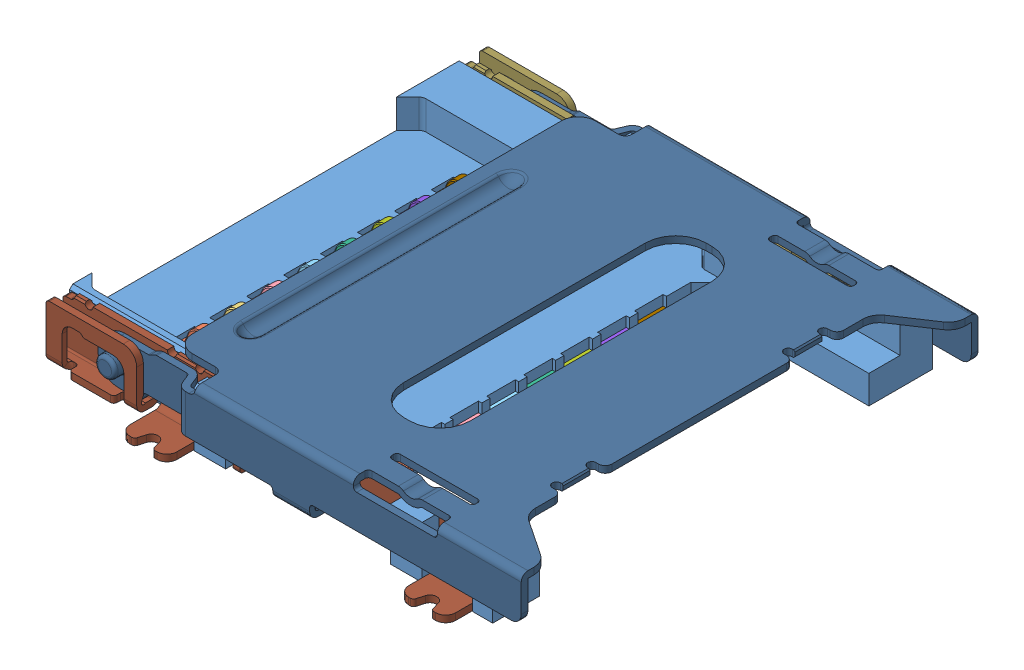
SolidWorks assembly User Library-112C-TXAR-R02_C_1.sldasm, configuration Default (file format 11000). Lengths in mm.
Overall size (14.4 2.04 14.6).
12 component instances, 12 part files, 0 mates.
Components (placement in the parent):
- User Library-112C-TXAR-R02_C_1_201-1-1: User Library-112C-TXAR-R02_C_1_201-1.sldprt [Default] at origin size (13.3 1.7 13.1)
- User Library-112C-TXAR-R02_C_1_301-1-1: User Library-112C-TXAR-R02_C_1_301-1.sldprt [Default] at origin size (8.11 1.33 0.86)
- User Library-112C-TXAR-R02_C_1_301_1-1-1: User Library-112C-TXAR-R02_C_1_301_1-1.sldprt [Default] at origin size (8.11 1.33 0.86)
- User Library-112C-TXAR-R02_C_1_301_2-1-1: User Library-112C-TXAR-R02_C_1_301_2-1.sldprt [Default] at origin size (8.11 1.33 0.86)
- User Library-112C-TXAR-R02_C_1_301_3-1-1: User Library-112C-TXAR-R02_C_1_301_3-1.sldprt [Default] at origin size (8.11 1.33 0.86)
- User Library-112C-TXAR-R02_C_1_301_4-1-1: User Library-112C-TXAR-R02_C_1_301_4-1.sldprt [Default] at origin size (8.11 1.33 0.86)
- User Library-112C-TXAR-R02_C_1_301_5-1-1: User Library-112C-TXAR-R02_C_1_301_5-1.sldprt [Default] at origin size (8.11 1.33 0.86)
- User Library-112C-TXAR-R02_C_1_301_6-1-1: User Library-112C-TXAR-R02_C_1_301_6-1.sldprt [Default] at origin size (8.11 1.33 0.86)
- User Library-112C-TXAR-R02_C_1_301_7-1-1: User Library-112C-TXAR-R02_C_1_301_7-1.sldprt [Default] at origin size (8.11 1.33 0.86)
- User Library-112C-TXAR-R02_C_1_401-1-1: User Library-112C-TXAR-R02_C_1_401-1.sldprt [Default] at origin size (13.1 1.85 13.6)
- User Library-112C-TXAR-R02_C_1_402_L-F-1-1: User Library-112C-TXAR-R02_C_1_402_L-F-1.sldprt [Default] at origin size (12.65 1.73 1.45)
- User Library-112C-TXAR-R02_C_1_402_R-F-1-1: User Library-112C-TXAR-R02_C_1_402_R-F-1.sldprt [Default] at origin size (12.65 1.73 1.45)
